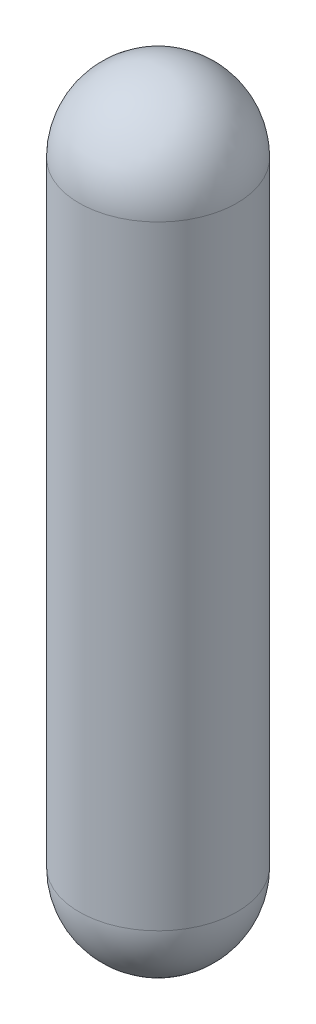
from build123d import *

# Parameters (mm, degrees)
SKETCH1_R           = 57.15
BOSS_EXTRUDE1_DEPTH = 558.8
FILLET1_R           = 57.15


with BuildPart() as part:
    # Sketch1 → Boss-Extrude1 (new body)
    with BuildSketch(Plane(origin=(0, 0, 0), x_dir=(1, 0, 0), z_dir=(0, 1, 0))):
        with Locations(Location((0, 0, 0), (0, 0, 270))):
            Circle(SKETCH1_R)
    extrude(amount=BOSS_EXTRUDE1_DEPTH)

    # Fillet1
    fillet1_edges = [part.edges().sort_by_distance(p)[0] for p in [
        (0, 0, -57.15),
        (0, 558.8, -57.15),
    ]]
    fillet(fillet1_edges, radius=FILLET1_R)


solid = part.part
